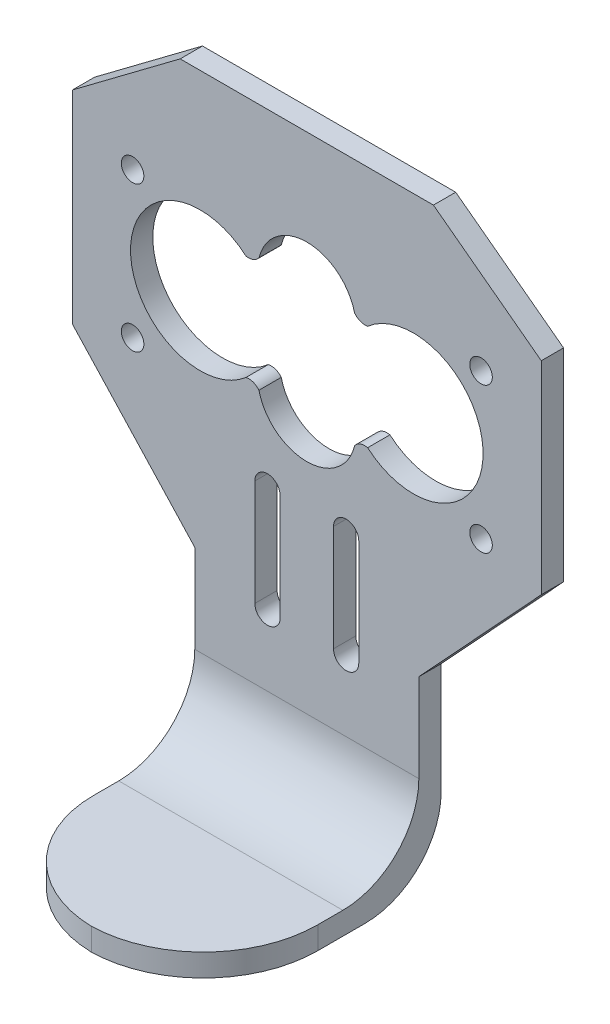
ISO-10303-21;
HEADER;
FILE_DESCRIPTION(('STEP AP214'),'2;1');
FILE_NAME('part.step','',(''),(''),'','','');
FILE_SCHEMA(('AUTOMOTIVE_DESIGN { 1 0 10303 214 1 1 1 1 }'));
ENDSEC;
DATA;
#1=APPLICATION_CONTEXT('core data for automotive mechanical design processes');
#2=APPLICATION_PROTOCOL_DEFINITION('international standard','automotive_design',2000,#1);
#3=PRODUCT_CONTEXT('',#1,'mechanical');
#4=PRODUCT('Part','Part','',(#3));
#5=PRODUCT_RELATED_PRODUCT_CATEGORY('part','',(#4));
#6=PRODUCT_DEFINITION_FORMATION('','',#4);
#7=PRODUCT_DEFINITION_CONTEXT('part definition',#1,'design');
#8=PRODUCT_DEFINITION('design','',#6,#7);
#9=PRODUCT_DEFINITION_SHAPE('','',#8);
#10=(LENGTH_UNIT() NAMED_UNIT(*) SI_UNIT(.MILLI.,.METRE.));
#11=(NAMED_UNIT(*) PLANE_ANGLE_UNIT() SI_UNIT($,.RADIAN.));
#12=(NAMED_UNIT(*) SI_UNIT($,.STERADIAN.) SOLID_ANGLE_UNIT());
#13=UNCERTAINTY_MEASURE_WITH_UNIT(LENGTH_MEASURE(1.E-05),#10,'distance_accuracy_value','');
#14=(GEOMETRIC_REPRESENTATION_CONTEXT(3) GLOBAL_UNCERTAINTY_ASSIGNED_CONTEXT((#13)) GLOBAL_UNIT_ASSIGNED_CONTEXT((#10,
#11,#12)) REPRESENTATION_CONTEXT('',''));
#15=CARTESIAN_POINT('',(0.,0.,0.));
#16=DIRECTION('',(0.,0.,1.));
#17=DIRECTION('',(1.,0.,0.));
#18=AXIS2_PLACEMENT_3D('',#15,#16,#17);
#19=CARTESIAN_POINT('',(0.,0.,2.7178));
#20=DIRECTION('',(0.,0.,-1.));
#21=DIRECTION('',(-1.,0.,0.));
#22=AXIS2_PLACEMENT_3D('',#19,#20,#21);
#23=PLANE('',#22);
#24=CARTESIAN_POINT('',(-4.79600559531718,-41.4152290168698,2.7178));
#25=DIRECTION('',(0.,0.,1.));
#26=DIRECTION('',(-1.,0.,0.));
#27=AXIS2_PLACEMENT_3D('',#24,#25,#26);
#28=CIRCLE('',#27,1.54131310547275);
#29=CARTESIAN_POINT('',(-6.33731870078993,-41.4152290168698,2.7178));
#30=VERTEX_POINT('',#29);
#31=CARTESIAN_POINT('',(-3.25469248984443,-41.4152290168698,2.7178));
#32=VERTEX_POINT('',#31);
#33=EDGE_CURVE('E236',#30,#32,#28,.T.);
#34=ORIENTED_EDGE('',*,*,#33,.F.);
#35=DIRECTION('',(0.,-1.,0.));
#36=VECTOR('',#35,1.);
#37=CARTESIAN_POINT('',(-6.33731870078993,-41.4152290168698,2.7178));
#38=LINE('',#37,#36);
#39=CARTESIAN_POINT('',(-6.33731870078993,-28.4893712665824,2.7178));
#40=VERTEX_POINT('',#39);
#41=EDGE_CURVE('E262',#40,#30,#38,.T.);
#42=ORIENTED_EDGE('',*,*,#41,.F.);
#43=CARTESIAN_POINT('',(-4.79600559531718,-28.4893712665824,2.7178));
#44=DIRECTION('',(0.,0.,1.));
#45=DIRECTION('',(-1.,0.,0.));
#46=AXIS2_PLACEMENT_3D('',#43,#44,#45);
#47=CIRCLE('',#46,1.54131310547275);
#48=CARTESIAN_POINT('',(-3.25469248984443,-28.4893712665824,2.7178));
#49=VERTEX_POINT('',#48);
#50=EDGE_CURVE('E260',#49,#40,#47,.T.);
#51=ORIENTED_EDGE('',*,*,#50,.F.);
#52=DIRECTION('',(0.,1.,0.));
#53=VECTOR('',#52,1.);
#54=CARTESIAN_POINT('',(-3.25469248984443,-41.4152290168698,2.7178));
#55=LINE('',#54,#53);
#56=EDGE_CURVE('E246',#32,#49,#55,.T.);
#57=ORIENTED_EDGE('',*,*,#56,.F.);
#58=EDGE_LOOP('',(#34,#42,#51,#57));
#59=FACE_BOUND('',#58,.T.);
#60=CARTESIAN_POINT('',(21.25,-20.8065728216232,2.7178));
#61=DIRECTION('',(0.,0.,1.));
#62=DIRECTION('',(1.,0.,0.));
#63=AXIS2_PLACEMENT_3D('',#60,#61,#62);
#64=CIRCLE('',#63,1.375);
#65=CARTESIAN_POINT('',(22.625,-20.8065728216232,2.7178));
#66=VERTEX_POINT('',#65);
#67=EDGE_CURVE('E311',#66,#66,#64,.T.);
#68=ORIENTED_EDGE('',*,*,#67,.F.);
#69=EDGE_LOOP('',(#68));
#70=FACE_BOUND('',#69,.T.);
#71=CARTESIAN_POINT('',(21.2500000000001,-3.05657282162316,2.7178));
#72=DIRECTION('',(0.,0.,1.));
#73=DIRECTION('',(1.,0.,0.));
#74=AXIS2_PLACEMENT_3D('',#71,#72,#73);
#75=CIRCLE('',#74,1.375);
#76=CARTESIAN_POINT('',(22.6250000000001,-3.05657282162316,2.7178));
#77=VERTEX_POINT('',#76);
#78=EDGE_CURVE('E317',#77,#77,#75,.T.);
#79=ORIENTED_EDGE('',*,*,#78,.F.);
#80=EDGE_LOOP('',(#79));
#81=FACE_BOUND('',#80,.T.);
#82=CARTESIAN_POINT('',(-21.25,-20.8065728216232,2.7178));
#83=DIRECTION('',(0.,0.,1.));
#84=DIRECTION('',(1.,0.,0.));
#85=AXIS2_PLACEMENT_3D('',#82,#83,#84);
#86=CIRCLE('',#85,1.375);
#87=CARTESIAN_POINT('',(-19.875,-20.8065728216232,2.7178));
#88=VERTEX_POINT('',#87);
#89=EDGE_CURVE('E323',#88,#88,#86,.T.);
#90=ORIENTED_EDGE('',*,*,#89,.F.);
#91=EDGE_LOOP('',(#90));
#92=FACE_BOUND('',#91,.T.);
#93=CARTESIAN_POINT('',(13.0000939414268,-11.6816523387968,2.7178));
#94=DIRECTION('',(0.,0.,1.));
#95=DIRECTION('',(-1.,0.,0.));
#96=AXIS2_PLACEMENT_3D('',#93,#94,#95);
#97=CIRCLE('',#96,8.49992048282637);
#98=CARTESIAN_POINT('',(7.42121408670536,-18.0945103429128,2.7178));
#99=VERTEX_POINT('',#98);
#100=CARTESIAN_POINT('',(7.41411637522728,-5.27497591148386,2.7178));
#101=VERTEX_POINT('',#100);
#102=EDGE_CURVE('E329',#99,#101,#97,.T.);
#103=ORIENTED_EDGE('',*,*,#102,.F.);
#104=CARTESIAN_POINT('',(7.07424417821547,-19.6293282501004,2.7178));
#105=DIRECTION('',(0.,0.,-1.));
#106=DIRECTION('',(1.,0.,0.));
#107=AXIS2_PLACEMENT_3D('',#104,#105,#106);
#108=CIRCLE('',#107,1.57354825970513);
#109=CARTESIAN_POINT('',(5.83957224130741,-18.6538082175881,2.7178));
#110=VERTEX_POINT('',#109);
#111=EDGE_CURVE('E345',#110,#99,#108,.T.);
#112=ORIENTED_EDGE('',*,*,#111,.F.);
#113=CARTESIAN_POINT('',(5.72376623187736E-05,-17.2753799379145,2.7178));
#114=DIRECTION('',(0.,0.,1.));
#115=DIRECTION('',(1.,0.,0.));
#116=AXIS2_PLACEMENT_3D('',#113,#114,#115);
#117=CIRCLE('',#116,6.);
#118=CARTESIAN_POINT('',(-5.83948406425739,-18.6536968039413,2.7178));
#119=VERTEX_POINT('',#118);
#120=EDGE_CURVE('E342',#119,#110,#117,.T.);
#121=ORIENTED_EDGE('',*,*,#120,.F.);
#122=CARTESIAN_POINT('',(-7.07393530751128,-19.6294589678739,2.7178));
#123=DIRECTION('',(0.,0.,-1.));
#124=DIRECTION('',(1.,0.,0.));
#125=AXIS2_PLACEMENT_3D('',#122,#123,#124);
#126=CIRCLE('',#125,1.57352523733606);
#127=CARTESIAN_POINT('',(-7.42053368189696,-18.0945807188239,2.7178));
#128=VERTEX_POINT('',#127);
#129=EDGE_CURVE('E340',#128,#119,#126,.T.);
#130=ORIENTED_EDGE('',*,*,#129,.F.);
#131=CARTESIAN_POINT('',(-12.9999060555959,-11.6820458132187,2.7178));
#132=DIRECTION('',(0.,0.,1.));
#133=DIRECTION('',(1.,0.,0.));
#134=AXIS2_PLACEMENT_3D('',#131,#132,#133);
#135=CIRCLE('',#134,8.5);
#136=CARTESIAN_POINT('',(-7.41411086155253,-5.27510488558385,2.7178));
#137=VERTEX_POINT('',#136);
#138=EDGE_CURVE('E338',#137,#128,#135,.T.);
#139=ORIENTED_EDGE('',*,*,#138,.F.);
#140=CARTESIAN_POINT('',(-7.11338771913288,-3.70168834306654,2.7178));
#141=DIRECTION('',(0.,0.,-1.));
#142=DIRECTION('',(-1.,0.,0.));
#143=AXIS2_PLACEMENT_3D('',#140,#141,#142);
#144=CIRCLE('',#143,1.60189700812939);
#145=CARTESIAN_POINT('',(-5.8295313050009,-4.65970020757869,2.7178));
#146=VERTEX_POINT('',#145);
#147=EDGE_CURVE('E336',#146,#137,#144,.T.);
#148=ORIENTED_EDGE('',*,*,#147,.F.);
#149=CARTESIAN_POINT('',(5.72376623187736E-05,-6.07952297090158,2.7178));
#150=DIRECTION('',(0.,0.,1.));
#151=DIRECTION('',(1.,0.,0.));
#152=AXIS2_PLACEMENT_3D('',#149,#150,#151);
#153=CIRCLE('',#152,5.99999993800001);
#154=CARTESIAN_POINT('',(5.82961869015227,-4.65958898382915,2.7178));
#155=VERTEX_POINT('',#154);
#156=EDGE_CURVE('E334',#155,#146,#153,.T.);
#157=ORIENTED_EDGE('',*,*,#156,.F.);
#158=CARTESIAN_POINT('',(7.1134630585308,-3.70152274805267,2.7178));
#159=DIRECTION('',(0.,0.,-1.));
#160=DIRECTION('',(-1.,0.,0.));
#161=AXIS2_PLACEMENT_3D('',#158,#159,#160);
#162=CIRCLE('',#161,1.60191987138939);
#163=EDGE_CURVE('E331',#101,#155,#162,.T.);
#164=ORIENTED_EDGE('',*,*,#163,.F.);
#165=EDGE_LOOP('',(#103,#112,#121,#130,#139,#148,#157,#164));
#166=FACE_BOUND('',#165,.T.);
#167=CARTESIAN_POINT('',(-21.25,-3.05657282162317,2.7178));
#168=DIRECTION('',(0.,0.,1.));
#169=DIRECTION('',(1.,0.,0.));
#170=AXIS2_PLACEMENT_3D('',#167,#168,#169);
#171=CIRCLE('',#170,1.375);
#172=CARTESIAN_POINT('',(-19.875,-3.05657282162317,2.7178));
#173=VERTEX_POINT('',#172);
#174=EDGE_CURVE('E388',#173,#173,#171,.T.);
#175=ORIENTED_EDGE('',*,*,#174,.F.);
#176=EDGE_LOOP('',(#175));
#177=FACE_BOUND('',#176,.T.);
#178=CARTESIAN_POINT('',(4.79600559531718,-41.4152290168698,2.7178));
#179=DIRECTION('',(0.,0.,1.));
#180=DIRECTION('',(1.,0.,0.));
#181=AXIS2_PLACEMENT_3D('',#178,#179,#180);
#182=CIRCLE('',#181,1.54131310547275);
#183=CARTESIAN_POINT('',(3.25469248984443,-41.4152290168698,2.7178));
#184=VERTEX_POINT('',#183);
#185=CARTESIAN_POINT('',(6.33731870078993,-41.4152290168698,2.7178));
#186=VERTEX_POINT('',#185);
#187=EDGE_CURVE('E280',#184,#186,#182,.T.);
#188=ORIENTED_EDGE('',*,*,#187,.F.);
#189=DIRECTION('',(0.,-1.,0.));
#190=VECTOR('',#189,1.);
#191=CARTESIAN_POINT('',(3.25469248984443,-41.4152290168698,2.7178));
#192=LINE('',#191,#190);
#193=CARTESIAN_POINT('',(3.25469248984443,-28.4893712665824,2.7178));
#194=VERTEX_POINT('',#193);
#195=EDGE_CURVE('E288',#194,#184,#192,.T.);
#196=ORIENTED_EDGE('',*,*,#195,.F.);
#197=CARTESIAN_POINT('',(4.79600559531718,-28.4893712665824,2.7178));
#198=DIRECTION('',(0.,0.,1.));
#199=DIRECTION('',(1.,0.,0.));
#200=AXIS2_PLACEMENT_3D('',#197,#198,#199);
#201=CIRCLE('',#200,1.54131310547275);
#202=CARTESIAN_POINT('',(6.33731870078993,-28.4893712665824,2.7178));
#203=VERTEX_POINT('',#202);
#204=EDGE_CURVE('E285',#203,#194,#201,.T.);
#205=ORIENTED_EDGE('',*,*,#204,.F.);
#206=DIRECTION('',(0.,1.,0.));
#207=VECTOR('',#206,1.);
#208=CARTESIAN_POINT('',(6.33731870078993,-41.4152290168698,2.7178));
#209=LINE('',#208,#207);
#210=EDGE_CURVE('E282',#186,#203,#209,.T.);
#211=ORIENTED_EDGE('',*,*,#210,.F.);
#212=EDGE_LOOP('',(#188,#196,#205,#211));
#213=FACE_BOUND('',#212,.T.);
#214=DIRECTION('',(0.,-1.,0.));
#215=VECTOR('',#214,1.);
#216=CARTESIAN_POINT('',(-13.6652,-39.1546922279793,2.7178));
#217=LINE('',#216,#215);
#218=CARTESIAN_POINT('',(-13.6652,-39.1546922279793,2.7178));
#219=VERTEX_POINT('',#218);
#220=CARTESIAN_POINT('',(-13.6652,-49.9242922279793,2.7178));
#221=VERTEX_POINT('',#220);
#222=EDGE_CURVE('E404',#219,#221,#217,.T.);
#223=ORIENTED_EDGE('',*,*,#222,.T.);
#224=DIRECTION('',(-1.,0.,0.));
#225=VECTOR('',#224,1.);
#226=CARTESIAN_POINT('',(13.6652,-49.9242922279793,2.7178));
#227=LINE('',#226,#225);
#228=CARTESIAN_POINT('',(13.6652,-49.9242922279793,2.7178));
#229=VERTEX_POINT('',#228);
#230=EDGE_CURVE('E464',#221,#229,#227,.F.);
#231=ORIENTED_EDGE('',*,*,#230,.T.);
#232=DIRECTION('',(0.,1.,0.));
#233=VECTOR('',#232,1.);
#234=CARTESIAN_POINT('',(13.6652,-39.1546922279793,2.7178));
#235=LINE('',#234,#233);
#236=CARTESIAN_POINT('',(13.6652,-39.1546922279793,2.7178));
#237=VERTEX_POINT('',#236);
#238=EDGE_CURVE('E407',#229,#237,#235,.T.);
#239=ORIENTED_EDGE('',*,*,#238,.T.);
#240=DIRECTION('',(0.679516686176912,0.733660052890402,0.));
#241=VECTOR('',#240,1.);
#242=CARTESIAN_POINT('',(28.5955219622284,-23.0347336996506,2.7178));
#243=LINE('',#242,#241);
#244=CARTESIAN_POINT('',(28.5955219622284,-23.0347336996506,2.7178));
#245=VERTEX_POINT('',#244);
#246=EDGE_CURVE('E409',#237,#245,#243,.T.);
#247=ORIENTED_EDGE('',*,*,#246,.T.);
#248=DIRECTION('',(0.,1.,0.));
#249=VECTOR('',#248,1.);
#250=CARTESIAN_POINT('',(28.5955219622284,1.67946630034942,2.7178));
#251=LINE('',#250,#249);
#252=CARTESIAN_POINT('',(28.5955219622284,1.67946630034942,2.7178));
#253=VERTEX_POINT('',#252);
#254=EDGE_CURVE('E411',#245,#253,#251,.T.);
#255=ORIENTED_EDGE('',*,*,#254,.T.);
#256=DIRECTION('',(-0.8,0.6,0.));
#257=VECTOR('',#256,1.);
#258=CARTESIAN_POINT('',(15.4432,11.5437077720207,2.7178));
#259=LINE('',#258,#257);
#260=CARTESIAN_POINT('',(15.4432,11.5437077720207,2.7178));
#261=VERTEX_POINT('',#260);
#262=EDGE_CURVE('E413',#253,#261,#259,.T.);
#263=ORIENTED_EDGE('',*,*,#262,.T.);
#264=DIRECTION('',(-1.,0.,0.));
#265=VECTOR('',#264,1.);
#266=CARTESIAN_POINT('',(-15.4431999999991,11.5437077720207,2.7178));
#267=LINE('',#266,#265);
#268=CARTESIAN_POINT('',(-15.4431999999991,11.5437077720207,2.7178));
#269=VERTEX_POINT('',#268);
#270=EDGE_CURVE('E394',#261,#269,#267,.T.);
#271=ORIENTED_EDGE('',*,*,#270,.T.);
#272=DIRECTION('',(-0.800000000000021,-0.599999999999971,0.));
#273=VECTOR('',#272,1.);
#274=CARTESIAN_POINT('',(-15.4431999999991,11.5437077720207,2.7178));
#275=LINE('',#274,#273);
#276=CARTESIAN_POINT('',(-28.5955219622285,1.67946630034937,2.7178));
#277=VERTEX_POINT('',#276);
#278=EDGE_CURVE('E397',#269,#277,#275,.T.);
#279=ORIENTED_EDGE('',*,*,#278,.T.);
#280=DIRECTION('',(0.,-1.,0.));
#281=VECTOR('',#280,1.);
#282=CARTESIAN_POINT('',(-28.5955219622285,1.67946630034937,2.7178));
#283=LINE('',#282,#281);
#284=CARTESIAN_POINT('',(-28.5955219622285,-23.0347336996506,2.7178));
#285=VERTEX_POINT('',#284);
#286=EDGE_CURVE('E400',#277,#285,#283,.T.);
#287=ORIENTED_EDGE('',*,*,#286,.T.);
#288=DIRECTION('',(0.679516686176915,-0.7336600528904,0.));
#289=VECTOR('',#288,1.);
#290=CARTESIAN_POINT('',(-28.5955219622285,-23.0347336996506,2.7178));
#291=LINE('',#290,#289);
#292=EDGE_CURVE('E402',#285,#219,#291,.T.);
#293=ORIENTED_EDGE('',*,*,#292,.T.);
#294=EDGE_LOOP('',(#223,#231,#239,#247,#255,#263,#271,#279,#287,#293));
#295=FACE_BOUND('',#294,.T.);
#296=ADVANCED_FACE('F35',(#59,#70,#81,#92,#166,#177,#213,#295),#23,.F.);
#297=CARTESIAN_POINT('',(0.,0.,0.));
#298=DIRECTION('',(0.,0.,-1.));
#299=DIRECTION('',(-1.,0.,0.));
#300=AXIS2_PLACEMENT_3D('',#297,#298,#299);
#301=PLANE('',#300);
#302=CARTESIAN_POINT('',(21.2500000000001,-3.05657282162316,0.));
#303=DIRECTION('',(0.,0.,1.));
#304=DIRECTION('',(1.,0.,0.));
#305=AXIS2_PLACEMENT_3D('',#302,#303,#304);
#306=CIRCLE('',#305,1.375);
#307=CARTESIAN_POINT('',(22.6250000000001,-3.05657282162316,0.));
#308=VERTEX_POINT('',#307);
#309=EDGE_CURVE('E314',#308,#308,#306,.T.);
#310=ORIENTED_EDGE('',*,*,#309,.T.);
#311=EDGE_LOOP('',(#310));
#312=FACE_BOUND('',#311,.T.);
#313=CARTESIAN_POINT('',(7.07424417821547,-19.6293282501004,0.));
#314=DIRECTION('',(0.,0.,-1.));
#315=DIRECTION('',(1.,0.,0.));
#316=AXIS2_PLACEMENT_3D('',#313,#314,#315);
#317=CIRCLE('',#316,1.57354825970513);
#318=CARTESIAN_POINT('',(5.83957224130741,-18.6538082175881,0.));
#319=VERTEX_POINT('',#318);
#320=CARTESIAN_POINT('',(7.42121408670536,-18.0945103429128,0.));
#321=VERTEX_POINT('',#320);
#322=EDGE_CURVE('E332',#319,#321,#317,.T.);
#323=ORIENTED_EDGE('',*,*,#322,.T.);
#324=CARTESIAN_POINT('',(13.0000939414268,-11.6816523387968,0.));
#325=DIRECTION('',(0.,0.,1.));
#326=DIRECTION('',(-1.,0.,0.));
#327=AXIS2_PLACEMENT_3D('',#324,#325,#326);
#328=CIRCLE('',#327,8.49992048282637);
#329=CARTESIAN_POINT('',(7.41411637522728,-5.27497591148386,0.));
#330=VERTEX_POINT('',#329);
#331=EDGE_CURVE('E326',#321,#330,#328,.T.);
#332=ORIENTED_EDGE('',*,*,#331,.T.);
#333=CARTESIAN_POINT('',(7.1134630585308,-3.70152274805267,0.));
#334=DIRECTION('',(0.,0.,-1.));
#335=DIRECTION('',(-1.,0.,0.));
#336=AXIS2_PLACEMENT_3D('',#333,#334,#335);
#337=CIRCLE('',#336,1.60191987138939);
#338=CARTESIAN_POINT('',(5.82961869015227,-4.65958898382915,0.));
#339=VERTEX_POINT('',#338);
#340=EDGE_CURVE('E350',#330,#339,#337,.T.);
#341=ORIENTED_EDGE('',*,*,#340,.T.);
#342=CARTESIAN_POINT('',(5.72376623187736E-05,-6.07952297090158,0.));
#343=DIRECTION('',(0.,0.,1.));
#344=DIRECTION('',(1.,0.,0.));
#345=AXIS2_PLACEMENT_3D('',#342,#343,#344);
#346=CIRCLE('',#345,5.99999993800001);
#347=CARTESIAN_POINT('',(-5.8295313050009,-4.65970020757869,0.));
#348=VERTEX_POINT('',#347);
#349=EDGE_CURVE('E353',#339,#348,#346,.T.);
#350=ORIENTED_EDGE('',*,*,#349,.T.);
#351=CARTESIAN_POINT('',(-7.11338771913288,-3.70168834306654,0.));
#352=DIRECTION('',(0.,0.,-1.));
#353=DIRECTION('',(-1.,0.,0.));
#354=AXIS2_PLACEMENT_3D('',#351,#352,#353);
#355=CIRCLE('',#354,1.60189700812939);
#356=CARTESIAN_POINT('',(-7.41411086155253,-5.27510488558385,0.));
#357=VERTEX_POINT('',#356);
#358=EDGE_CURVE('E356',#348,#357,#355,.T.);
#359=ORIENTED_EDGE('',*,*,#358,.T.);
#360=CARTESIAN_POINT('',(-12.9999060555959,-11.6820458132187,0.));
#361=DIRECTION('',(0.,0.,1.));
#362=DIRECTION('',(1.,0.,0.));
#363=AXIS2_PLACEMENT_3D('',#360,#361,#362);
#364=CIRCLE('',#363,8.5);
#365=CARTESIAN_POINT('',(-7.42053368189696,-18.0945807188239,0.));
#366=VERTEX_POINT('',#365);
#367=EDGE_CURVE('E359',#357,#366,#364,.T.);
#368=ORIENTED_EDGE('',*,*,#367,.T.);
#369=CARTESIAN_POINT('',(-7.07393530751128,-19.6294589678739,0.));
#370=DIRECTION('',(0.,0.,-1.));
#371=DIRECTION('',(1.,0.,0.));
#372=AXIS2_PLACEMENT_3D('',#369,#370,#371);
#373=CIRCLE('',#372,1.57352523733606);
#374=CARTESIAN_POINT('',(-5.83948406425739,-18.6536968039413,0.));
#375=VERTEX_POINT('',#374);
#376=EDGE_CURVE('E362',#366,#375,#373,.T.);
#377=ORIENTED_EDGE('',*,*,#376,.T.);
#378=CARTESIAN_POINT('',(5.72376623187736E-05,-17.2753799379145,0.));
#379=DIRECTION('',(0.,0.,1.));
#380=DIRECTION('',(1.,0.,0.));
#381=AXIS2_PLACEMENT_3D('',#378,#379,#380);
#382=CIRCLE('',#381,6.);
#383=EDGE_CURVE('E365',#375,#319,#382,.T.);
#384=ORIENTED_EDGE('',*,*,#383,.T.);
#385=EDGE_LOOP('',(#323,#332,#341,#350,#359,#368,#377,#384));
#386=FACE_BOUND('',#385,.T.);
#387=CARTESIAN_POINT('',(-21.25,-3.05657282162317,0.));
#388=DIRECTION('',(0.,0.,1.));
#389=DIRECTION('',(1.,0.,0.));
#390=AXIS2_PLACEMENT_3D('',#387,#388,#389);
#391=CIRCLE('',#390,1.375);
#392=CARTESIAN_POINT('',(-19.875,-3.05657282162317,0.));
#393=VERTEX_POINT('',#392);
#394=EDGE_CURVE('E387',#393,#393,#391,.T.);
#395=ORIENTED_EDGE('',*,*,#394,.T.);
#396=EDGE_LOOP('',(#395));
#397=FACE_BOUND('',#396,.T.);
#398=DIRECTION('',(0.,1.,0.));
#399=VECTOR('',#398,1.);
#400=CARTESIAN_POINT('',(13.6652,-39.1546922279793,0.));
#401=LINE('',#400,#399);
#402=CARTESIAN_POINT('',(13.6652,-52.6674922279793,0.));
#403=VERTEX_POINT('',#402);
#404=CARTESIAN_POINT('',(13.6652,-39.1546922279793,0.));
#405=VERTEX_POINT('',#404);
#406=EDGE_CURVE('E427',#403,#405,#401,.T.);
#407=ORIENTED_EDGE('',*,*,#406,.F.);
#408=DIRECTION('',(1.,0.,0.));
#409=VECTOR('',#408,1.);
#410=CARTESIAN_POINT('',(-13.6652,-52.6674922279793,0.));
#411=LINE('',#410,#409);
#412=CARTESIAN_POINT('',(-13.6652,-52.6674922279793,0.));
#413=VERTEX_POINT('',#412);
#414=EDGE_CURVE('E471',#403,#413,#411,.F.);
#415=ORIENTED_EDGE('',*,*,#414,.T.);
#416=DIRECTION('',(0.,-1.,0.));
#417=VECTOR('',#416,1.);
#418=CARTESIAN_POINT('',(-13.6652,-39.1546922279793,0.));
#419=LINE('',#418,#417);
#420=CARTESIAN_POINT('',(-13.6652,-39.1546922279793,0.));
#421=VERTEX_POINT('',#420);
#422=EDGE_CURVE('E424',#421,#413,#419,.T.);
#423=ORIENTED_EDGE('',*,*,#422,.F.);
#424=DIRECTION('',(0.679516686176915,-0.7336600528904,0.));
#425=VECTOR('',#424,1.);
#426=CARTESIAN_POINT('',(-28.5955219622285,-23.0347336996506,0.));
#427=LINE('',#426,#425);
#428=CARTESIAN_POINT('',(-28.5955219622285,-23.0347336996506,0.));
#429=VERTEX_POINT('',#428);
#430=EDGE_CURVE('E422',#429,#421,#427,.T.);
#431=ORIENTED_EDGE('',*,*,#430,.F.);
#432=DIRECTION('',(0.,-1.,0.));
#433=VECTOR('',#432,1.);
#434=CARTESIAN_POINT('',(-28.5955219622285,1.67946630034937,0.));
#435=LINE('',#434,#433);
#436=CARTESIAN_POINT('',(-28.5955219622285,1.67946630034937,0.));
#437=VERTEX_POINT('',#436);
#438=EDGE_CURVE('E420',#437,#429,#435,.T.);
#439=ORIENTED_EDGE('',*,*,#438,.F.);
#440=DIRECTION('',(-0.800000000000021,-0.599999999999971,0.));
#441=VECTOR('',#440,1.);
#442=CARTESIAN_POINT('',(-15.4431999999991,11.5437077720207,0.));
#443=LINE('',#442,#441);
#444=CARTESIAN_POINT('',(-15.4431999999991,11.5437077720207,0.));
#445=VERTEX_POINT('',#444);
#446=EDGE_CURVE('E418',#445,#437,#443,.T.);
#447=ORIENTED_EDGE('',*,*,#446,.F.);
#448=DIRECTION('',(-1.,0.,0.));
#449=VECTOR('',#448,1.);
#450=CARTESIAN_POINT('',(-15.4431999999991,11.5437077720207,0.));
#451=LINE('',#450,#449);
#452=CARTESIAN_POINT('',(15.4432,11.5437077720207,0.));
#453=VERTEX_POINT('',#452);
#454=EDGE_CURVE('E391',#453,#445,#451,.T.);
#455=ORIENTED_EDGE('',*,*,#454,.F.);
#456=DIRECTION('',(-0.8,0.6,0.));
#457=VECTOR('',#456,1.);
#458=CARTESIAN_POINT('',(15.4432,11.5437077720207,0.));
#459=LINE('',#458,#457);
#460=CARTESIAN_POINT('',(28.5955219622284,1.67946630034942,0.));
#461=VERTEX_POINT('',#460);
#462=EDGE_CURVE('E398',#461,#453,#459,.T.);
#463=ORIENTED_EDGE('',*,*,#462,.F.);
#464=DIRECTION('',(0.,1.,0.));
#465=VECTOR('',#464,1.);
#466=CARTESIAN_POINT('',(28.5955219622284,1.67946630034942,0.));
#467=LINE('',#466,#465);
#468=CARTESIAN_POINT('',(28.5955219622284,-23.0347336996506,0.));
#469=VERTEX_POINT('',#468);
#470=EDGE_CURVE('E431',#469,#461,#467,.T.);
#471=ORIENTED_EDGE('',*,*,#470,.F.);
#472=DIRECTION('',(0.679516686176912,0.733660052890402,0.));
#473=VECTOR('',#472,1.);
#474=CARTESIAN_POINT('',(28.5955219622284,-23.0347336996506,0.));
#475=LINE('',#474,#473);
#476=EDGE_CURVE('E429',#405,#469,#475,.T.);
#477=ORIENTED_EDGE('',*,*,#476,.F.);
#478=EDGE_LOOP('',(#407,#415,#423,#431,#439,#447,#455,#463,#471,#477));
#479=FACE_BOUND('',#478,.T.);
#480=CARTESIAN_POINT('',(-21.25,-20.8065728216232,0.));
#481=DIRECTION('',(0.,0.,1.));
#482=DIRECTION('',(1.,0.,0.));
#483=AXIS2_PLACEMENT_3D('',#480,#481,#482);
#484=CIRCLE('',#483,1.375);
#485=CARTESIAN_POINT('',(-19.875,-20.8065728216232,0.));
#486=VERTEX_POINT('',#485);
#487=EDGE_CURVE('E320',#486,#486,#484,.T.);
#488=ORIENTED_EDGE('',*,*,#487,.T.);
#489=EDGE_LOOP('',(#488));
#490=FACE_BOUND('',#489,.T.);
#491=CARTESIAN_POINT('',(21.25,-20.8065728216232,0.));
#492=DIRECTION('',(0.,0.,1.));
#493=DIRECTION('',(1.,0.,0.));
#494=AXIS2_PLACEMENT_3D('',#491,#492,#493);
#495=CIRCLE('',#494,1.375);
#496=CARTESIAN_POINT('',(22.625,-20.8065728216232,0.));
#497=VERTEX_POINT('',#496);
#498=EDGE_CURVE('E310',#497,#497,#495,.T.);
#499=ORIENTED_EDGE('',*,*,#498,.T.);
#500=EDGE_LOOP('',(#499));
#501=FACE_BOUND('',#500,.T.);
#502=DIRECTION('',(0.,-1.,0.));
#503=VECTOR('',#502,1.);
#504=CARTESIAN_POINT('',(3.25469248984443,-41.4152290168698,0.));
#505=LINE('',#504,#503);
#506=CARTESIAN_POINT('',(3.25469248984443,-28.4893712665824,0.));
#507=VERTEX_POINT('',#506);
#508=CARTESIAN_POINT('',(3.25469248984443,-41.4152290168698,0.));
#509=VERTEX_POINT('',#508);
#510=EDGE_CURVE('E283',#507,#509,#505,.T.);
#511=ORIENTED_EDGE('',*,*,#510,.T.);
#512=CARTESIAN_POINT('',(4.79600559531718,-41.4152290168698,0.));
#513=DIRECTION('',(0.,0.,1.));
#514=DIRECTION('',(1.,0.,0.));
#515=AXIS2_PLACEMENT_3D('',#512,#513,#514);
#516=CIRCLE('',#515,1.54131310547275);
#517=CARTESIAN_POINT('',(6.33731870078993,-41.4152290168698,0.));
#518=VERTEX_POINT('',#517);
#519=EDGE_CURVE('E254',#509,#518,#516,.T.);
#520=ORIENTED_EDGE('',*,*,#519,.T.);
#521=DIRECTION('',(0.,1.,0.));
#522=VECTOR('',#521,1.);
#523=CARTESIAN_POINT('',(6.33731870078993,-41.4152290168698,0.));
#524=LINE('',#523,#522);
#525=CARTESIAN_POINT('',(6.33731870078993,-28.4893712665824,0.));
#526=VERTEX_POINT('',#525);
#527=EDGE_CURVE('E293',#518,#526,#524,.T.);
#528=ORIENTED_EDGE('',*,*,#527,.T.);
#529=CARTESIAN_POINT('',(4.79600559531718,-28.4893712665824,0.));
#530=DIRECTION('',(0.,0.,1.));
#531=DIRECTION('',(1.,0.,0.));
#532=AXIS2_PLACEMENT_3D('',#529,#530,#531);
#533=CIRCLE('',#532,1.54131310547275);
#534=EDGE_CURVE('E296',#526,#507,#533,.T.);
#535=ORIENTED_EDGE('',*,*,#534,.T.);
#536=EDGE_LOOP('',(#511,#520,#528,#535));
#537=FACE_BOUND('',#536,.T.);
#538=DIRECTION('',(0.,-1.,0.));
#539=VECTOR('',#538,1.);
#540=CARTESIAN_POINT('',(-6.33731870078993,-41.4152290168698,0.));
#541=LINE('',#540,#539);
#542=CARTESIAN_POINT('',(-6.33731870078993,-28.4893712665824,0.));
#543=VERTEX_POINT('',#542);
#544=CARTESIAN_POINT('',(-6.33731870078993,-41.4152290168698,0.));
#545=VERTEX_POINT('',#544);
#546=EDGE_CURVE('E247',#543,#545,#541,.T.);
#547=ORIENTED_EDGE('',*,*,#546,.T.);
#548=CARTESIAN_POINT('',(-4.79600559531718,-41.4152290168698,0.));
#549=DIRECTION('',(0.,0.,1.));
#550=DIRECTION('',(-1.,0.,0.));
#551=AXIS2_PLACEMENT_3D('',#548,#549,#550);
#552=CIRCLE('',#551,1.54131310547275);
#553=CARTESIAN_POINT('',(-3.25469248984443,-41.4152290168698,0.));
#554=VERTEX_POINT('',#553);
#555=EDGE_CURVE('E267',#545,#554,#552,.T.);
#556=ORIENTED_EDGE('',*,*,#555,.T.);
#557=DIRECTION('',(0.,1.,0.));
#558=VECTOR('',#557,1.);
#559=CARTESIAN_POINT('',(-3.25469248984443,-41.4152290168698,0.));
#560=LINE('',#559,#558);
#561=CARTESIAN_POINT('',(-3.25469248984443,-28.4893712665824,0.));
#562=VERTEX_POINT('',#561);
#563=EDGE_CURVE('E253',#554,#562,#560,.T.);
#564=ORIENTED_EDGE('',*,*,#563,.T.);
#565=CARTESIAN_POINT('',(-4.79600559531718,-28.4893712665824,0.));
#566=DIRECTION('',(0.,0.,1.));
#567=DIRECTION('',(-1.,0.,0.));
#568=AXIS2_PLACEMENT_3D('',#565,#566,#567);
#569=CIRCLE('',#568,1.54131310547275);
#570=EDGE_CURVE('E271',#562,#543,#569,.T.);
#571=ORIENTED_EDGE('',*,*,#570,.T.);
#572=EDGE_LOOP('',(#547,#556,#564,#571));
#573=FACE_BOUND('',#572,.T.);
#574=ADVANCED_FACE('F506',(#312,#386,#397,#479,#490,#501,#537,#573),#301,.T.);
#575=CARTESIAN_POINT('',(-15.4431999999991,11.5437077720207,2.7178));
#576=DIRECTION('',(0.,-1.,0.));
#577=DIRECTION('',(1.,0.,0.));
#578=AXIS2_PLACEMENT_3D('',#575,#576,#577);
#579=PLANE('',#578);
#580=ORIENTED_EDGE('',*,*,#454,.T.);
#581=DIRECTION('',(0.,0.,-1.));
#582=VECTOR('',#581,1.);
#583=CARTESIAN_POINT('',(-15.4431999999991,11.5437077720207,2.7178));
#584=LINE('',#583,#582);
#585=EDGE_CURVE('E458',#269,#445,#584,.T.);
#586=ORIENTED_EDGE('',*,*,#585,.F.);
#587=ORIENTED_EDGE('',*,*,#270,.F.);
#588=DIRECTION('',(0.,0.,-1.));
#589=VECTOR('',#588,1.);
#590=CARTESIAN_POINT('',(15.4432,11.5437077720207,2.7178));
#591=LINE('',#590,#589);
#592=EDGE_CURVE('E415',#261,#453,#591,.T.);
#593=ORIENTED_EDGE('',*,*,#592,.T.);
#594=EDGE_LOOP('',(#580,#586,#587,#593));
#595=FACE_BOUND('',#594,.T.);
#596=ADVANCED_FACE('F559',(#595),#579,.F.);
#597=CARTESIAN_POINT('',(-15.4431999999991,11.5437077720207,2.7178));
#598=DIRECTION('',(0.599999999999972,-0.800000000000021,0.));
#599=DIRECTION('',(0.800000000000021,0.599999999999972,0.));
#600=AXIS2_PLACEMENT_3D('',#597,#598,#599);
#601=PLANE('',#600);
#602=ORIENTED_EDGE('',*,*,#446,.T.);
#603=DIRECTION('',(0.,0.,-1.));
#604=VECTOR('',#603,1.);
#605=CARTESIAN_POINT('',(-28.5955219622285,1.67946630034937,2.7178));
#606=LINE('',#605,#604);
#607=EDGE_CURVE('E455',#277,#437,#606,.T.);
#608=ORIENTED_EDGE('',*,*,#607,.F.);
#609=ORIENTED_EDGE('',*,*,#278,.F.);
#610=ORIENTED_EDGE('',*,*,#585,.T.);
#611=EDGE_LOOP('',(#602,#608,#609,#610));
#612=FACE_BOUND('',#611,.T.);
#613=ADVANCED_FACE('F555',(#612),#601,.F.);
#614=CARTESIAN_POINT('',(-28.5955219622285,1.67946630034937,2.7178));
#615=DIRECTION('',(1.,0.,0.));
#616=DIRECTION('',(0.,1.,0.));
#617=AXIS2_PLACEMENT_3D('',#614,#615,#616);
#618=PLANE('',#617);
#619=ORIENTED_EDGE('',*,*,#438,.T.);
#620=DIRECTION('',(0.,0.,-1.));
#621=VECTOR('',#620,1.);
#622=CARTESIAN_POINT('',(-28.5955219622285,-23.0347336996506,2.7178));
#623=LINE('',#622,#621);
#624=EDGE_CURVE('E452',#285,#429,#623,.T.);
#625=ORIENTED_EDGE('',*,*,#624,.F.);
#626=ORIENTED_EDGE('',*,*,#286,.F.);
#627=ORIENTED_EDGE('',*,*,#607,.T.);
#628=EDGE_LOOP('',(#619,#625,#626,#627));
#629=FACE_BOUND('',#628,.T.);
#630=ADVANCED_FACE('F552',(#629),#618,.F.);
#631=CARTESIAN_POINT('',(-28.5955219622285,-23.0347336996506,2.7178));
#632=DIRECTION('',(0.7336600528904,0.679516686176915,0.));
#633=DIRECTION('',(-0.679516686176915,0.7336600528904,0.));
#634=AXIS2_PLACEMENT_3D('',#631,#632,#633);
#635=PLANE('',#634);
#636=ORIENTED_EDGE('',*,*,#430,.T.);
#637=DIRECTION('',(0.,0.,-1.));
#638=VECTOR('',#637,1.);
#639=CARTESIAN_POINT('',(-13.6652,-39.1546922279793,2.7178));
#640=LINE('',#639,#638);
#641=EDGE_CURVE('E449',#219,#421,#640,.T.);
#642=ORIENTED_EDGE('',*,*,#641,.F.);
#643=ORIENTED_EDGE('',*,*,#292,.F.);
#644=ORIENTED_EDGE('',*,*,#624,.T.);
#645=EDGE_LOOP('',(#636,#642,#643,#644));
#646=FACE_BOUND('',#645,.T.);
#647=ADVANCED_FACE('F547',(#646),#635,.F.);
#648=CARTESIAN_POINT('',(-13.6652,-39.1546922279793,2.7178));
#649=DIRECTION('',(1.,0.,0.));
#650=DIRECTION('',(0.,1.,0.));
#651=AXIS2_PLACEMENT_3D('',#648,#649,#650);
#652=PLANE('',#651);
#653=DIRECTION('',(0.,0.,-1.));
#654=VECTOR('',#653,1.);
#655=CARTESIAN_POINT('',(-13.6652,-61.9384922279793,2.7178));
#656=LINE('',#655,#654);
#657=CARTESIAN_POINT('',(-13.6652,-61.9384922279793,15.0368));
#658=VERTEX_POINT('',#657);
#659=CARTESIAN_POINT('',(-13.6652,-61.9384922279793,9.271));
#660=VERTEX_POINT('',#659);
#661=EDGE_CURVE('E447',#658,#660,#656,.T.);
#662=ORIENTED_EDGE('',*,*,#661,.F.);
#663=DIRECTION('',(0.,-1.,0.));
#664=VECTOR('',#663,1.);
#665=CARTESIAN_POINT('',(-13.6652,-39.1546922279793,15.0368));
#666=LINE('',#665,#664);
#667=CARTESIAN_POINT('',(-13.6652,-59.1952922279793,15.0368));
#668=VERTEX_POINT('',#667);
#669=EDGE_CURVE('E11',#658,#668,#666,.F.);
#670=ORIENTED_EDGE('',*,*,#669,.T.);
#671=DIRECTION('',(0.,0.,-1.));
#672=VECTOR('',#671,1.);
#673=CARTESIAN_POINT('',(-13.6652,-59.1952922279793,29.0068));
#674=LINE('',#673,#672);
#675=CARTESIAN_POINT('',(-13.6652,-59.1952922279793,11.9888));
#676=VERTEX_POINT('',#675);
#677=EDGE_CURVE('E532',#668,#676,#674,.T.);
#678=ORIENTED_EDGE('',*,*,#677,.T.);
#679=CARTESIAN_POINT('',(-13.6652,-49.9242922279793,11.9888));
#680=DIRECTION('',(1.,0.,0.));
#681=DIRECTION('',(0.,1.,0.));
#682=AXIS2_PLACEMENT_3D('',#679,#680,#681);
#683=CIRCLE('',#682,9.271);
#684=EDGE_CURVE('E476',#676,#221,#683,.T.);
#685=ORIENTED_EDGE('',*,*,#684,.T.);
#686=ORIENTED_EDGE('',*,*,#222,.F.);
#687=ORIENTED_EDGE('',*,*,#641,.T.);
#688=ORIENTED_EDGE('',*,*,#422,.T.);
#689=CARTESIAN_POINT('',(-13.6652,-52.6674922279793,9.271));
#690=DIRECTION('',(1.,0.,0.));
#691=DIRECTION('',(0.,1.,0.));
#692=AXIS2_PLACEMENT_3D('',#689,#690,#691);
#693=CIRCLE('',#692,9.271);
#694=EDGE_CURVE('E473',#413,#660,#693,.F.);
#695=ORIENTED_EDGE('',*,*,#694,.T.);
#696=EDGE_LOOP('',(#662,#670,#678,#685,#686,#687,#688,#695));
#697=FACE_BOUND('',#696,.T.);
#698=ADVANCED_FACE('F541',(#697),#652,.F.);
#699=CARTESIAN_POINT('',(-13.6652,-61.9384922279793,2.7178));
#700=DIRECTION('',(0.,1.,0.));
#701=DIRECTION('',(0.,0.,1.));
#702=AXIS2_PLACEMENT_3D('',#699,#700,#701);
#703=PLANE('',#702);
#704=DIRECTION('',(0.,0.,-1.));
#705=VECTOR('',#704,1.);
#706=CARTESIAN_POINT('',(13.6652,-61.9384922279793,2.7178));
#707=LINE('',#706,#705);
#708=CARTESIAN_POINT('',(13.6652,-61.9384922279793,15.0368));
#709=VERTEX_POINT('',#708);
#710=CARTESIAN_POINT('',(13.6652,-61.9384922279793,9.271));
#711=VERTEX_POINT('',#710);
#712=EDGE_CURVE('E445',#709,#711,#707,.T.);
#713=ORIENTED_EDGE('',*,*,#712,.F.);
#714=CARTESIAN_POINT('',(-0.304799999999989,-61.9384922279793,15.0368));
#715=DIRECTION('',(0.,1.,0.));
#716=DIRECTION('',(0.,0.,1.));
#717=AXIS2_PLACEMENT_3D('',#714,#715,#716);
#718=CIRCLE('',#717,13.97);
#719=CARTESIAN_POINT('',(0.,-61.9384922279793,29.0034745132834));
#720=VERTEX_POINT('',#719);
#721=EDGE_CURVE('E44',#709,#720,#718,.F.);
#722=ORIENTED_EDGE('',*,*,#721,.T.);
#723=CARTESIAN_POINT('',(0.304799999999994,-61.9384922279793,15.0368));
#724=DIRECTION('',(0.,1.,0.));
#725=DIRECTION('',(0.,0.,1.));
#726=AXIS2_PLACEMENT_3D('',#723,#724,#725);
#727=CIRCLE('',#726,13.97);
#728=EDGE_CURVE('E54',#720,#658,#727,.F.);
#729=ORIENTED_EDGE('',*,*,#728,.T.);
#730=ORIENTED_EDGE('',*,*,#661,.T.);
#731=DIRECTION('',(1.,0.,0.));
#732=VECTOR('',#731,1.);
#733=CARTESIAN_POINT('',(13.6652,-61.9384922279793,9.271));
#734=LINE('',#733,#732);
#735=EDGE_CURVE('E466',#660,#711,#734,.T.);
#736=ORIENTED_EDGE('',*,*,#735,.T.);
#737=EDGE_LOOP('',(#713,#722,#729,#730,#736));
#738=FACE_BOUND('',#737,.T.);
#739=ADVANCED_FACE('F496',(#738),#703,.F.);
#740=CARTESIAN_POINT('',(13.6652,-39.1546922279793,2.7178));
#741=DIRECTION('',(-1.,0.,0.));
#742=DIRECTION('',(0.,-1.,0.));
#743=AXIS2_PLACEMENT_3D('',#740,#741,#742);
#744=PLANE('',#743);
#745=DIRECTION('',(0.,0.,-1.));
#746=VECTOR('',#745,1.);
#747=CARTESIAN_POINT('',(13.6652,-59.1952922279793,29.0068));
#748=LINE('',#747,#746);
#749=CARTESIAN_POINT('',(13.6652,-59.1952922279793,15.0368));
#750=VERTEX_POINT('',#749);
#751=CARTESIAN_POINT('',(13.6652,-59.1952922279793,11.9888));
#752=VERTEX_POINT('',#751);
#753=EDGE_CURVE('E269',#750,#752,#748,.T.);
#754=ORIENTED_EDGE('',*,*,#753,.F.);
#755=DIRECTION('',(0.,1.,0.));
#756=VECTOR('',#755,1.);
#757=CARTESIAN_POINT('',(13.6652,-39.1546922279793,15.0368));
#758=LINE('',#757,#756);
#759=EDGE_CURVE('E485',#750,#709,#758,.F.);
#760=ORIENTED_EDGE('',*,*,#759,.T.);
#761=ORIENTED_EDGE('',*,*,#712,.T.);
#762=CARTESIAN_POINT('',(13.6652,-52.6674922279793,9.271));
#763=DIRECTION('',(-1.,0.,0.));
#764=DIRECTION('',(0.,-1.,0.));
#765=AXIS2_PLACEMENT_3D('',#762,#763,#764);
#766=CIRCLE('',#765,9.271);
#767=EDGE_CURVE('E469',#711,#403,#766,.F.);
#768=ORIENTED_EDGE('',*,*,#767,.T.);
#769=ORIENTED_EDGE('',*,*,#406,.T.);
#770=DIRECTION('',(0.,0.,-1.));
#771=VECTOR('',#770,1.);
#772=CARTESIAN_POINT('',(13.6652,-39.1546922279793,2.7178));
#773=LINE('',#772,#771);
#774=EDGE_CURVE('E442',#237,#405,#773,.T.);
#775=ORIENTED_EDGE('',*,*,#774,.F.);
#776=ORIENTED_EDGE('',*,*,#238,.F.);
#777=CARTESIAN_POINT('',(13.6652,-49.9242922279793,11.9888));
#778=DIRECTION('',(-1.,0.,0.));
#779=DIRECTION('',(0.,-1.,0.));
#780=AXIS2_PLACEMENT_3D('',#777,#778,#779);
#781=CIRCLE('',#780,9.271);
#782=EDGE_CURVE('E478',#229,#752,#781,.T.);
#783=ORIENTED_EDGE('',*,*,#782,.T.);
#784=EDGE_LOOP('',(#754,#760,#761,#768,#769,#775,#776,#783));
#785=FACE_BOUND('',#784,.T.);
#786=ADVANCED_FACE('F492',(#785),#744,.F.);
#787=CARTESIAN_POINT('',(28.5955219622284,-23.0347336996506,2.7178));
#788=DIRECTION('',(-0.733660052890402,0.679516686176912,0.));
#789=DIRECTION('',(-0.679516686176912,-0.733660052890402,0.));
#790=AXIS2_PLACEMENT_3D('',#787,#788,#789);
#791=PLANE('',#790);
#792=ORIENTED_EDGE('',*,*,#476,.T.);
#793=DIRECTION('',(0.,0.,-1.));
#794=VECTOR('',#793,1.);
#795=CARTESIAN_POINT('',(28.5955219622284,-23.0347336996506,2.7178));
#796=LINE('',#795,#794);
#797=EDGE_CURVE('E439',#245,#469,#796,.T.);
#798=ORIENTED_EDGE('',*,*,#797,.F.);
#799=ORIENTED_EDGE('',*,*,#246,.F.);
#800=ORIENTED_EDGE('',*,*,#774,.T.);
#801=EDGE_LOOP('',(#792,#798,#799,#800));
#802=FACE_BOUND('',#801,.T.);
#803=ADVANCED_FACE('F513',(#802),#791,.F.);
#804=CARTESIAN_POINT('',(28.5955219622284,1.67946630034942,2.7178));
#805=DIRECTION('',(-1.,0.,0.));
#806=DIRECTION('',(0.,-1.,0.));
#807=AXIS2_PLACEMENT_3D('',#804,#805,#806);
#808=PLANE('',#807);
#809=ORIENTED_EDGE('',*,*,#470,.T.);
#810=DIRECTION('',(0.,0.,-1.));
#811=VECTOR('',#810,1.);
#812=CARTESIAN_POINT('',(28.5955219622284,1.67946630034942,2.7178));
#813=LINE('',#812,#811);
#814=EDGE_CURVE('E436',#253,#461,#813,.T.);
#815=ORIENTED_EDGE('',*,*,#814,.F.);
#816=ORIENTED_EDGE('',*,*,#254,.F.);
#817=ORIENTED_EDGE('',*,*,#797,.T.);
#818=EDGE_LOOP('',(#809,#815,#816,#817));
#819=FACE_BOUND('',#818,.T.);
#820=ADVANCED_FACE('F517',(#819),#808,.F.);
#821=CARTESIAN_POINT('',(15.4432,11.5437077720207,2.7178));
#822=DIRECTION('',(-0.6,-0.8,0.));
#823=DIRECTION('',(0.8,-0.6,0.));
#824=AXIS2_PLACEMENT_3D('',#821,#822,#823);
#825=PLANE('',#824);
#826=ORIENTED_EDGE('',*,*,#462,.T.);
#827=ORIENTED_EDGE('',*,*,#592,.F.);
#828=ORIENTED_EDGE('',*,*,#262,.F.);
#829=ORIENTED_EDGE('',*,*,#814,.T.);
#830=EDGE_LOOP('',(#826,#827,#828,#829));
#831=FACE_BOUND('',#830,.T.);
#832=ADVANCED_FACE('F562',(#831),#825,.F.);
#833=CARTESIAN_POINT('',(-21.25,-3.05657282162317,2.7178));
#834=DIRECTION('',(0.,0.,-1.));
#835=DIRECTION('',(-1.,0.,0.));
#836=AXIS2_PLACEMENT_3D('',#833,#834,#835);
#837=CYLINDRICAL_SURFACE('',#836,1.375);
#838=ORIENTED_EDGE('',*,*,#174,.T.);
#839=EDGE_LOOP('',(#838));
#840=FACE_BOUND('',#839,.T.);
#841=ORIENTED_EDGE('',*,*,#394,.F.);
#842=EDGE_LOOP('',(#841));
#843=FACE_BOUND('',#842,.T.);
#844=ADVANCED_FACE('F564',(#840,#843),#837,.F.);
#845=CARTESIAN_POINT('',(13.0000939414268,-11.6816523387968,2.7178));
#846=DIRECTION('',(0.,0.,-1.));
#847=DIRECTION('',(-1.,0.,0.));
#848=AXIS2_PLACEMENT_3D('',#845,#846,#847);
#849=CYLINDRICAL_SURFACE('',#848,8.49992048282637);
#850=ORIENTED_EDGE('',*,*,#331,.F.);
#851=DIRECTION('',(0.,0.,-1.));
#852=VECTOR('',#851,1.);
#853=CARTESIAN_POINT('',(7.42121408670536,-18.0945103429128,2.7178));
#854=LINE('',#853,#852);
#855=EDGE_CURVE('E347',#99,#321,#854,.T.);
#856=ORIENTED_EDGE('',*,*,#855,.F.);
#857=ORIENTED_EDGE('',*,*,#102,.T.);
#858=DIRECTION('',(0.,0.,-1.));
#859=VECTOR('',#858,1.);
#860=CARTESIAN_POINT('',(7.41411637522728,-5.27497591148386,2.7178));
#861=LINE('',#860,#859);
#862=EDGE_CURVE('E384',#101,#330,#861,.T.);
#863=ORIENTED_EDGE('',*,*,#862,.T.);
#864=EDGE_LOOP('',(#850,#856,#857,#863));
#865=FACE_BOUND('',#864,.T.);
#866=ADVANCED_FACE('F570',(#865),#849,.F.);
#867=CARTESIAN_POINT('',(7.1134630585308,-3.70152274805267,2.7178));
#868=DIRECTION('',(0.,0.,-1.));
#869=DIRECTION('',(-1.,0.,0.));
#870=AXIS2_PLACEMENT_3D('',#867,#868,#869);
#871=CYLINDRICAL_SURFACE('',#870,1.60191987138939);
#872=ORIENTED_EDGE('',*,*,#340,.F.);
#873=ORIENTED_EDGE('',*,*,#862,.F.);
#874=ORIENTED_EDGE('',*,*,#163,.T.);
#875=DIRECTION('',(0.,0.,-1.));
#876=VECTOR('',#875,1.);
#877=CARTESIAN_POINT('',(5.82961869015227,-4.65958898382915,2.7178));
#878=LINE('',#877,#876);
#879=EDGE_CURVE('E382',#155,#339,#878,.T.);
#880=ORIENTED_EDGE('',*,*,#879,.T.);
#881=EDGE_LOOP('',(#872,#873,#874,#880));
#882=FACE_BOUND('',#881,.T.);
#883=ADVANCED_FACE('F584',(#882),#871,.T.);
#884=CARTESIAN_POINT('',(5.72376623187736E-05,-6.07952297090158,2.7178));
#885=DIRECTION('',(0.,0.,-1.));
#886=DIRECTION('',(-1.,0.,0.));
#887=AXIS2_PLACEMENT_3D('',#884,#885,#886);
#888=CYLINDRICAL_SURFACE('',#887,5.99999993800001);
#889=ORIENTED_EDGE('',*,*,#349,.F.);
#890=ORIENTED_EDGE('',*,*,#879,.F.);
#891=ORIENTED_EDGE('',*,*,#156,.T.);
#892=DIRECTION('',(0.,0.,-1.));
#893=VECTOR('',#892,1.);
#894=CARTESIAN_POINT('',(-5.8295313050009,-4.65970020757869,2.7178));
#895=LINE('',#894,#893);
#896=EDGE_CURVE('E380',#146,#348,#895,.T.);
#897=ORIENTED_EDGE('',*,*,#896,.T.);
#898=EDGE_LOOP('',(#889,#890,#891,#897));
#899=FACE_BOUND('',#898,.T.);
#900=ADVANCED_FACE('F588',(#899),#888,.F.);
#901=CARTESIAN_POINT('',(-7.11338771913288,-3.70168834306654,2.7178));
#902=DIRECTION('',(0.,0.,-1.));
#903=DIRECTION('',(-1.,0.,0.));
#904=AXIS2_PLACEMENT_3D('',#901,#902,#903);
#905=CYLINDRICAL_SURFACE('',#904,1.60189700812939);
#906=ORIENTED_EDGE('',*,*,#358,.F.);
#907=ORIENTED_EDGE('',*,*,#896,.F.);
#908=ORIENTED_EDGE('',*,*,#147,.T.);
#909=DIRECTION('',(0.,0.,-1.));
#910=VECTOR('',#909,1.);
#911=CARTESIAN_POINT('',(-7.41411086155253,-5.27510488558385,2.7178));
#912=LINE('',#911,#910);
#913=EDGE_CURVE('E378',#137,#357,#912,.T.);
#914=ORIENTED_EDGE('',*,*,#913,.T.);
#915=EDGE_LOOP('',(#906,#907,#908,#914));
#916=FACE_BOUND('',#915,.T.);
#917=ADVANCED_FACE('F592',(#916),#905,.T.);
#918=CARTESIAN_POINT('',(-12.9999060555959,-11.6820458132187,2.7178));
#919=DIRECTION('',(0.,0.,-1.));
#920=DIRECTION('',(-1.,0.,0.));
#921=AXIS2_PLACEMENT_3D('',#918,#919,#920);
#922=CYLINDRICAL_SURFACE('',#921,8.5);
#923=ORIENTED_EDGE('',*,*,#367,.F.);
#924=ORIENTED_EDGE('',*,*,#913,.F.);
#925=ORIENTED_EDGE('',*,*,#138,.T.);
#926=DIRECTION('',(0.,0.,-1.));
#927=VECTOR('',#926,1.);
#928=CARTESIAN_POINT('',(-7.42053368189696,-18.0945807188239,2.7178));
#929=LINE('',#928,#927);
#930=EDGE_CURVE('E376',#128,#366,#929,.T.);
#931=ORIENTED_EDGE('',*,*,#930,.T.);
#932=EDGE_LOOP('',(#923,#924,#925,#931));
#933=FACE_BOUND('',#932,.T.);
#934=ADVANCED_FACE('F596',(#933),#922,.F.);
#935=CARTESIAN_POINT('',(-7.07393530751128,-19.6294589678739,2.7178));
#936=DIRECTION('',(0.,0.,-1.));
#937=DIRECTION('',(-1.,0.,0.));
#938=AXIS2_PLACEMENT_3D('',#935,#936,#937);
#939=CYLINDRICAL_SURFACE('',#938,1.57352523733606);
#940=ORIENTED_EDGE('',*,*,#376,.F.);
#941=ORIENTED_EDGE('',*,*,#930,.F.);
#942=ORIENTED_EDGE('',*,*,#129,.T.);
#943=DIRECTION('',(0.,0.,-1.));
#944=VECTOR('',#943,1.);
#945=CARTESIAN_POINT('',(-5.83948406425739,-18.6536968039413,2.7178));
#946=LINE('',#945,#944);
#947=EDGE_CURVE('E374',#119,#375,#946,.T.);
#948=ORIENTED_EDGE('',*,*,#947,.T.);
#949=EDGE_LOOP('',(#940,#941,#942,#948));
#950=FACE_BOUND('',#949,.T.);
#951=ADVANCED_FACE('F600',(#950),#939,.T.);
#952=CARTESIAN_POINT('',(5.72376623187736E-05,-17.2753799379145,2.7178));
#953=DIRECTION('',(0.,0.,-1.));
#954=DIRECTION('',(-1.,0.,0.));
#955=AXIS2_PLACEMENT_3D('',#952,#953,#954);
#956=CYLINDRICAL_SURFACE('',#955,6.);
#957=ORIENTED_EDGE('',*,*,#383,.F.);
#958=ORIENTED_EDGE('',*,*,#947,.F.);
#959=ORIENTED_EDGE('',*,*,#120,.T.);
#960=DIRECTION('',(0.,0.,-1.));
#961=VECTOR('',#960,1.);
#962=CARTESIAN_POINT('',(5.83957224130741,-18.6538082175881,2.7178));
#963=LINE('',#962,#961);
#964=EDGE_CURVE('E372',#110,#319,#963,.T.);
#965=ORIENTED_EDGE('',*,*,#964,.T.);
#966=EDGE_LOOP('',(#957,#958,#959,#965));
#967=FACE_BOUND('',#966,.T.);
#968=ADVANCED_FACE('F604',(#967),#956,.F.);
#969=CARTESIAN_POINT('',(7.07424417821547,-19.6293282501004,2.7178));
#970=DIRECTION('',(0.,0.,-1.));
#971=DIRECTION('',(-1.,0.,0.));
#972=AXIS2_PLACEMENT_3D('',#969,#970,#971);
#973=CYLINDRICAL_SURFACE('',#972,1.57354825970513);
#974=ORIENTED_EDGE('',*,*,#322,.F.);
#975=ORIENTED_EDGE('',*,*,#964,.F.);
#976=ORIENTED_EDGE('',*,*,#111,.T.);
#977=ORIENTED_EDGE('',*,*,#855,.T.);
#978=EDGE_LOOP('',(#974,#975,#976,#977));
#979=FACE_BOUND('',#978,.T.);
#980=ADVANCED_FACE('F608',(#979),#973,.T.);
#981=CARTESIAN_POINT('',(-21.25,-20.8065728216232,2.7178));
#982=DIRECTION('',(0.,0.,-1.));
#983=DIRECTION('',(-1.,0.,0.));
#984=AXIS2_PLACEMENT_3D('',#981,#982,#983);
#985=CYLINDRICAL_SURFACE('',#984,1.375);
#986=ORIENTED_EDGE('',*,*,#89,.T.);
#987=EDGE_LOOP('',(#986));
#988=FACE_BOUND('',#987,.T.);
#989=ORIENTED_EDGE('',*,*,#487,.F.);
#990=EDGE_LOOP('',(#989));
#991=FACE_BOUND('',#990,.T.);
#992=ADVANCED_FACE('F612',(#988,#991),#985,.F.);
#993=CARTESIAN_POINT('',(21.2500000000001,-3.05657282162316,2.7178));
#994=DIRECTION('',(0.,0.,-1.));
#995=DIRECTION('',(-1.,0.,0.));
#996=AXIS2_PLACEMENT_3D('',#993,#994,#995);
#997=CYLINDRICAL_SURFACE('',#996,1.375);
#998=ORIENTED_EDGE('',*,*,#78,.T.);
#999=EDGE_LOOP('',(#998));
#1000=FACE_BOUND('',#999,.T.);
#1001=ORIENTED_EDGE('',*,*,#309,.F.);
#1002=EDGE_LOOP('',(#1001));
#1003=FACE_BOUND('',#1002,.T.);
#1004=ADVANCED_FACE('F616',(#1000,#1003),#997,.F.);
#1005=CARTESIAN_POINT('',(21.25,-20.8065728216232,2.7178));
#1006=DIRECTION('',(0.,0.,-1.));
#1007=DIRECTION('',(-1.,0.,0.));
#1008=AXIS2_PLACEMENT_3D('',#1005,#1006,#1007);
#1009=CYLINDRICAL_SURFACE('',#1008,1.375);
#1010=ORIENTED_EDGE('',*,*,#67,.T.);
#1011=EDGE_LOOP('',(#1010));
#1012=FACE_BOUND('',#1011,.T.);
#1013=ORIENTED_EDGE('',*,*,#498,.F.);
#1014=EDGE_LOOP('',(#1013));
#1015=FACE_BOUND('',#1014,.T.);
#1016=ADVANCED_FACE('F620',(#1012,#1015),#1009,.F.);
#1017=CARTESIAN_POINT('',(4.79600559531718,-41.4152290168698,2.7178));
#1018=DIRECTION('',(0.,0.,-1.));
#1019=DIRECTION('',(-1.,0.,0.));
#1020=AXIS2_PLACEMENT_3D('',#1017,#1018,#1019);
#1021=CYLINDRICAL_SURFACE('',#1020,1.54131310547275);
#1022=ORIENTED_EDGE('',*,*,#519,.F.);
#1023=DIRECTION('',(0.,0.,-1.));
#1024=VECTOR('',#1023,1.);
#1025=CARTESIAN_POINT('',(3.25469248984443,-41.4152290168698,2.7178));
#1026=LINE('',#1025,#1024);
#1027=EDGE_CURVE('E290',#184,#509,#1026,.T.);
#1028=ORIENTED_EDGE('',*,*,#1027,.F.);
#1029=ORIENTED_EDGE('',*,*,#187,.T.);
#1030=DIRECTION('',(0.,0.,-1.));
#1031=VECTOR('',#1030,1.);
#1032=CARTESIAN_POINT('',(6.33731870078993,-41.4152290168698,2.7178));
#1033=LINE('',#1032,#1031);
#1034=EDGE_CURVE('E307',#186,#518,#1033,.T.);
#1035=ORIENTED_EDGE('',*,*,#1034,.T.);
#1036=EDGE_LOOP('',(#1022,#1028,#1029,#1035));
#1037=FACE_BOUND('',#1036,.T.);
#1038=ADVANCED_FACE('F624',(#1037),#1021,.F.);
#1039=CARTESIAN_POINT('',(6.33731870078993,-41.4152290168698,2.7178));
#1040=DIRECTION('',(-1.,0.,0.));
#1041=DIRECTION('',(0.,0.,1.));
#1042=AXIS2_PLACEMENT_3D('',#1039,#1040,#1041);
#1043=PLANE('',#1042);
#1044=ORIENTED_EDGE('',*,*,#527,.F.);
#1045=ORIENTED_EDGE('',*,*,#1034,.F.);
#1046=ORIENTED_EDGE('',*,*,#210,.T.);
#1047=DIRECTION('',(0.,0.,-1.));
#1048=VECTOR('',#1047,1.);
#1049=CARTESIAN_POINT('',(6.33731870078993,-28.4893712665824,2.7178));
#1050=LINE('',#1049,#1048);
#1051=EDGE_CURVE('E305',#203,#526,#1050,.T.);
#1052=ORIENTED_EDGE('',*,*,#1051,.T.);
#1053=EDGE_LOOP('',(#1044,#1045,#1046,#1052));
#1054=FACE_BOUND('',#1053,.T.);
#1055=ADVANCED_FACE('F628',(#1054),#1043,.T.);
#1056=CARTESIAN_POINT('',(4.79600559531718,-28.4893712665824,2.7178));
#1057=DIRECTION('',(0.,0.,-1.));
#1058=DIRECTION('',(-1.,0.,0.));
#1059=AXIS2_PLACEMENT_3D('',#1056,#1057,#1058);
#1060=CYLINDRICAL_SURFACE('',#1059,1.54131310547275);
#1061=ORIENTED_EDGE('',*,*,#534,.F.);
#1062=ORIENTED_EDGE('',*,*,#1051,.F.);
#1063=ORIENTED_EDGE('',*,*,#204,.T.);
#1064=DIRECTION('',(0.,0.,-1.));
#1065=VECTOR('',#1064,1.);
#1066=CARTESIAN_POINT('',(3.25469248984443,-28.4893712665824,2.7178));
#1067=LINE('',#1066,#1065);
#1068=EDGE_CURVE('E303',#194,#507,#1067,.T.);
#1069=ORIENTED_EDGE('',*,*,#1068,.T.);
#1070=EDGE_LOOP('',(#1061,#1062,#1063,#1069));
#1071=FACE_BOUND('',#1070,.T.);
#1072=ADVANCED_FACE('F632',(#1071),#1060,.F.);
#1073=CARTESIAN_POINT('',(3.25469248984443,-41.4152290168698,2.7178));
#1074=DIRECTION('',(1.,0.,0.));
#1075=DIRECTION('',(0.,0.,-1.));
#1076=AXIS2_PLACEMENT_3D('',#1073,#1074,#1075);
#1077=PLANE('',#1076);
#1078=ORIENTED_EDGE('',*,*,#510,.F.);
#1079=ORIENTED_EDGE('',*,*,#1068,.F.);
#1080=ORIENTED_EDGE('',*,*,#195,.T.);
#1081=ORIENTED_EDGE('',*,*,#1027,.T.);
#1082=EDGE_LOOP('',(#1078,#1079,#1080,#1081));
#1083=FACE_BOUND('',#1082,.T.);
#1084=ADVANCED_FACE('F636',(#1083),#1077,.T.);
#1085=CARTESIAN_POINT('',(-4.79600559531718,-41.4152290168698,2.7178));
#1086=DIRECTION('',(0.,0.,-1.));
#1087=DIRECTION('',(-1.,0.,0.));
#1088=AXIS2_PLACEMENT_3D('',#1085,#1086,#1087);
#1089=CYLINDRICAL_SURFACE('',#1088,1.54131310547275);
#1090=ORIENTED_EDGE('',*,*,#555,.F.);
#1091=DIRECTION('',(0.,0.,-1.));
#1092=VECTOR('',#1091,1.);
#1093=CARTESIAN_POINT('',(-6.33731870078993,-41.4152290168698,2.7178));
#1094=LINE('',#1093,#1092);
#1095=EDGE_CURVE('E242',#30,#545,#1094,.T.);
#1096=ORIENTED_EDGE('',*,*,#1095,.F.);
#1097=ORIENTED_EDGE('',*,*,#33,.T.);
#1098=DIRECTION('',(0.,0.,-1.));
#1099=VECTOR('',#1098,1.);
#1100=CARTESIAN_POINT('',(-3.25469248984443,-41.4152290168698,2.7178));
#1101=LINE('',#1100,#1099);
#1102=EDGE_CURVE('E239',#32,#554,#1101,.T.);
#1103=ORIENTED_EDGE('',*,*,#1102,.T.);
#1104=EDGE_LOOP('',(#1090,#1096,#1097,#1103));
#1105=FACE_BOUND('',#1104,.T.);
#1106=ADVANCED_FACE('F238',(#1105),#1089,.F.);
#1107=CARTESIAN_POINT('',(-3.25469248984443,-41.4152290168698,2.7178));
#1108=DIRECTION('',(-1.,0.,0.));
#1109=DIRECTION('',(0.,0.,1.));
#1110=AXIS2_PLACEMENT_3D('',#1107,#1108,#1109);
#1111=PLANE('',#1110);
#1112=ORIENTED_EDGE('',*,*,#563,.F.);
#1113=ORIENTED_EDGE('',*,*,#1102,.F.);
#1114=ORIENTED_EDGE('',*,*,#56,.T.);
#1115=DIRECTION('',(0.,0.,-1.));
#1116=VECTOR('',#1115,1.);
#1117=CARTESIAN_POINT('',(-3.25469248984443,-28.4893712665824,2.7178));
#1118=LINE('',#1117,#1116);
#1119=EDGE_CURVE('E255',#49,#562,#1118,.T.);
#1120=ORIENTED_EDGE('',*,*,#1119,.T.);
#1121=EDGE_LOOP('',(#1112,#1113,#1114,#1120));
#1122=FACE_BOUND('',#1121,.T.);
#1123=ADVANCED_FACE('F250',(#1122),#1111,.T.);
#1124=CARTESIAN_POINT('',(-4.79600559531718,-28.4893712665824,2.7178));
#1125=DIRECTION('',(0.,0.,-1.));
#1126=DIRECTION('',(-1.,0.,0.));
#1127=AXIS2_PLACEMENT_3D('',#1124,#1125,#1126);
#1128=CYLINDRICAL_SURFACE('',#1127,1.54131310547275);
#1129=ORIENTED_EDGE('',*,*,#570,.F.);
#1130=ORIENTED_EDGE('',*,*,#1119,.F.);
#1131=ORIENTED_EDGE('',*,*,#50,.T.);
#1132=DIRECTION('',(0.,0.,-1.));
#1133=VECTOR('',#1132,1.);
#1134=CARTESIAN_POINT('',(-6.33731870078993,-28.4893712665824,2.7178));
#1135=LINE('',#1134,#1133);
#1136=EDGE_CURVE('E277',#40,#543,#1135,.T.);
#1137=ORIENTED_EDGE('',*,*,#1136,.T.);
#1138=EDGE_LOOP('',(#1129,#1130,#1131,#1137));
#1139=FACE_BOUND('',#1138,.T.);
#1140=ADVANCED_FACE('F645',(#1139),#1128,.F.);
#1141=CARTESIAN_POINT('',(-6.33731870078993,-41.4152290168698,2.7178));
#1142=DIRECTION('',(1.,0.,0.));
#1143=DIRECTION('',(0.,0.,-1.));
#1144=AXIS2_PLACEMENT_3D('',#1141,#1142,#1143);
#1145=PLANE('',#1144);
#1146=ORIENTED_EDGE('',*,*,#546,.F.);
#1147=ORIENTED_EDGE('',*,*,#1136,.F.);
#1148=ORIENTED_EDGE('',*,*,#41,.T.);
#1149=ORIENTED_EDGE('',*,*,#1095,.T.);
#1150=EDGE_LOOP('',(#1146,#1147,#1148,#1149));
#1151=FACE_BOUND('',#1150,.T.);
#1152=ADVANCED_FACE('F648',(#1151),#1145,.T.);
#1153=CARTESIAN_POINT('',(-13.6652,-59.1952922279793,29.0068));
#1154=DIRECTION('',(0.,-1.,0.));
#1155=DIRECTION('',(0.,0.,-1.));
#1156=AXIS2_PLACEMENT_3D('',#1153,#1154,#1155);
#1157=PLANE('',#1156);
#1158=CARTESIAN_POINT('',(0.304799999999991,-59.1952922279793,15.0368));
#1159=DIRECTION('',(0.,-1.,0.));
#1160=DIRECTION('',(0.,0.,-1.));
#1161=AXIS2_PLACEMENT_3D('',#1158,#1159,#1160);
#1162=CIRCLE('',#1161,13.97);
#1163=CARTESIAN_POINT('',(0.,-59.1952922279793,29.0034745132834));
#1164=VERTEX_POINT('',#1163);
#1165=EDGE_CURVE('E481',#668,#1164,#1162,.F.);
#1166=ORIENTED_EDGE('',*,*,#1165,.T.);
#1167=CARTESIAN_POINT('',(-0.304799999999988,-59.1952922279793,15.0368));
#1168=DIRECTION('',(0.,-1.,0.));
#1169=DIRECTION('',(0.,0.,-1.));
#1170=AXIS2_PLACEMENT_3D('',#1167,#1168,#1169);
#1171=CIRCLE('',#1170,13.97);
#1172=EDGE_CURVE('E483',#1164,#750,#1171,.F.);
#1173=ORIENTED_EDGE('',*,*,#1172,.T.);
#1174=ORIENTED_EDGE('',*,*,#753,.T.);
#1175=DIRECTION('',(-1.,0.,0.));
#1176=VECTOR('',#1175,1.);
#1177=CARTESIAN_POINT('',(-13.6652,-59.1952922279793,11.9888));
#1178=LINE('',#1177,#1176);
#1179=EDGE_CURVE('E461',#752,#676,#1178,.T.);
#1180=ORIENTED_EDGE('',*,*,#1179,.T.);
#1181=ORIENTED_EDGE('',*,*,#677,.F.);
#1182=EDGE_LOOP('',(#1166,#1173,#1174,#1180,#1181));
#1183=FACE_BOUND('',#1182,.T.);
#1184=ADVANCED_FACE('F531',(#1183),#1157,.F.);
#1185=CARTESIAN_POINT('',(-13.6652,-49.9242922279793,11.9888));
#1186=DIRECTION('',(1.,0.,0.));
#1187=DIRECTION('',(0.,0.,-1.));
#1188=AXIS2_PLACEMENT_3D('',#1185,#1186,#1187);
#1189=CYLINDRICAL_SURFACE('',#1188,9.271);
#1190=ORIENTED_EDGE('',*,*,#782,.F.);
#1191=ORIENTED_EDGE('',*,*,#230,.F.);
#1192=ORIENTED_EDGE('',*,*,#684,.F.);
#1193=ORIENTED_EDGE('',*,*,#1179,.F.);
#1194=EDGE_LOOP('',(#1190,#1191,#1192,#1193));
#1195=FACE_BOUND('',#1194,.T.);
#1196=ADVANCED_FACE('F527',(#1195),#1189,.F.);
#1197=CARTESIAN_POINT('',(-13.6652,-52.6674922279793,9.271));
#1198=DIRECTION('',(-1.,0.,0.));
#1199=DIRECTION('',(0.,0.,1.));
#1200=AXIS2_PLACEMENT_3D('',#1197,#1198,#1199);
#1201=CYLINDRICAL_SURFACE('',#1200,9.271);
#1202=ORIENTED_EDGE('',*,*,#694,.F.);
#1203=ORIENTED_EDGE('',*,*,#414,.F.);
#1204=ORIENTED_EDGE('',*,*,#767,.F.);
#1205=ORIENTED_EDGE('',*,*,#735,.F.);
#1206=EDGE_LOOP('',(#1202,#1203,#1204,#1205));
#1207=FACE_BOUND('',#1206,.T.);
#1208=ADVANCED_FACE('F500',(#1207),#1201,.T.);
#1209=CARTESIAN_POINT('',(0.304799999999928,0.,15.0368));
#1210=DIRECTION('',(0.,-1.,0.));
#1211=DIRECTION('',(1.,0.,0.));
#1212=AXIS2_PLACEMENT_3D('',#1209,#1210,#1211);
#1213=CYLINDRICAL_SURFACE('',#1212,13.97);
#1214=ORIENTED_EDGE('',*,*,#669,.F.);
#1215=ORIENTED_EDGE('',*,*,#728,.F.);
#1216=DIRECTION('',(0.,-1.,0.));
#1217=VECTOR('',#1216,1.);
#1218=CARTESIAN_POINT('',(0.,-60.5668922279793,29.0034745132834));
#1219=LINE('',#1218,#1217);
#1220=EDGE_CURVE('E39',#1164,#720,#1219,.T.);
#1221=ORIENTED_EDGE('',*,*,#1220,.F.);
#1222=ORIENTED_EDGE('',*,*,#1165,.F.);
#1223=EDGE_LOOP('',(#1214,#1215,#1221,#1222));
#1224=FACE_BOUND('',#1223,.T.);
#1225=ADVANCED_FACE('F37',(#1224),#1213,.T.);
#1226=CARTESIAN_POINT('',(-0.30479999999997,0.,15.0368));
#1227=DIRECTION('',(0.,1.,0.));
#1228=DIRECTION('',(-1.,0.,0.));
#1229=AXIS2_PLACEMENT_3D('',#1226,#1227,#1228);
#1230=CYLINDRICAL_SURFACE('',#1229,13.97);
#1231=ORIENTED_EDGE('',*,*,#721,.F.);
#1232=ORIENTED_EDGE('',*,*,#759,.F.);
#1233=ORIENTED_EDGE('',*,*,#1172,.F.);
#1234=ORIENTED_EDGE('',*,*,#1220,.T.);
#1235=EDGE_LOOP('',(#1231,#1232,#1233,#1234));
#1236=FACE_BOUND('',#1235,.T.);
#1237=ADVANCED_FACE('F538',(#1236),#1230,.T.);
#1238=CLOSED_SHELL('',(#296,#574,#596,#613,#630,#647,#698,#739,#786,#803,#820,#832,#844,#866,
#883,#900,#917,#934,#951,#968,#980,#992,#1004,#1016,#1038,#1055,#1072,#1084,#1106,#1123,#1140,
#1152,#1184,#1196,#1208,#1225,#1237));
#1239=MANIFOLD_SOLID_BREP('B2',#1238);
#1240=ADVANCED_BREP_SHAPE_REPRESENTATION('',(#18,#1239),#14);
#1241=SHAPE_DEFINITION_REPRESENTATION(#9,#1240);
ENDSEC;
END-ISO-10303-21;
